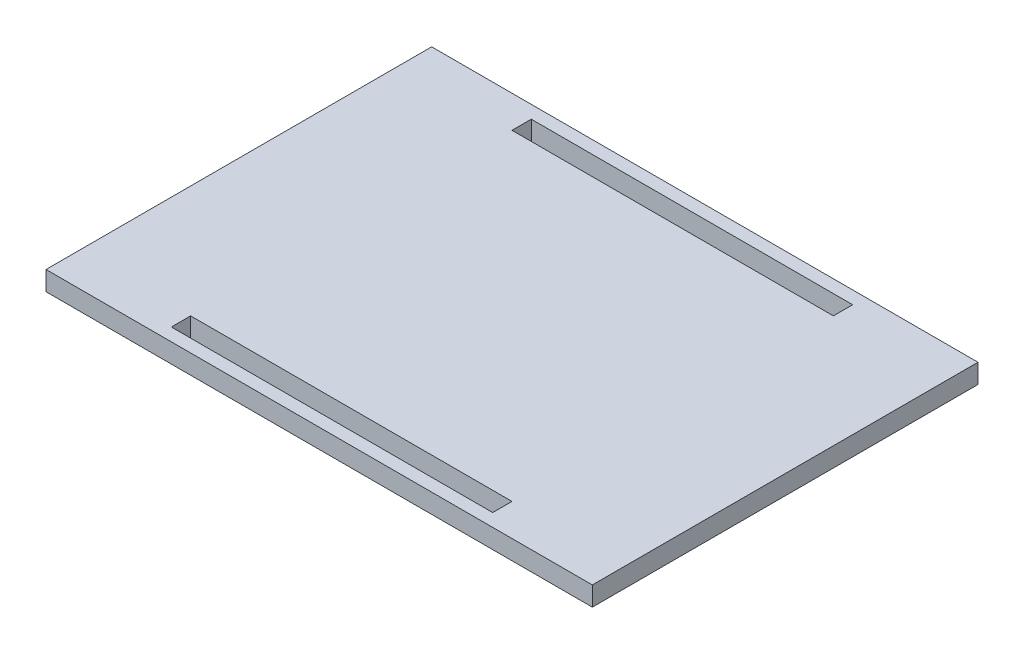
from build123d import *

# Parameters (mm, degrees)
SKETCH1_W           = 85
SKETCH1_H           = 60
SKETCH1_W_2         = 50
SKETCH1_H_2         = 3
BOSS_EXTRUDE1_DEPTH = 3


with BuildPart() as part:
    # Sketch1 → Boss-Extrude1 (new body)
    with BuildSketch(Plane(origin=(0, 0, 0), x_dir=(1, 0, 0), z_dir=(0, 1, 0))):
        Rectangle(SKETCH1_W, SKETCH1_H)
        with Locations((0, 26.5)):
            Rectangle(SKETCH1_W_2, SKETCH1_H_2, mode=Mode.SUBTRACT)
        with Locations((0, -26.5)):
            Rectangle(SKETCH1_W_2, SKETCH1_H_2, mode=Mode.SUBTRACT)
    extrude(amount=BOSS_EXTRUDE1_DEPTH)


solid = part.part
